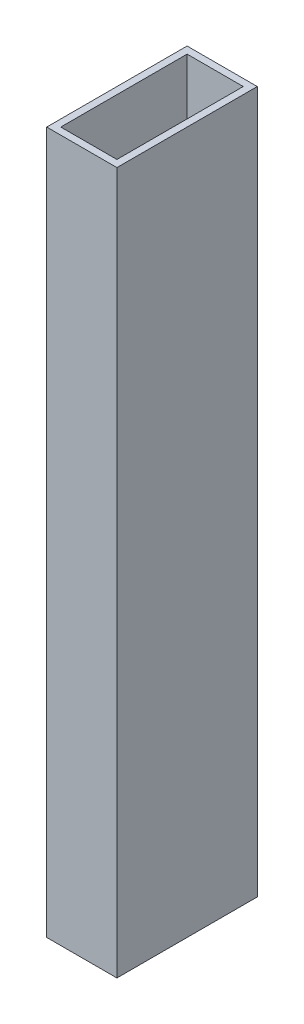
ISO-10303-21;
HEADER;
FILE_DESCRIPTION(('STEP AP214'),'2;1');
FILE_NAME('part.step','',(''),(''),'','','');
FILE_SCHEMA(('AUTOMOTIVE_DESIGN { 1 0 10303 214 1 1 1 1 }'));
ENDSEC;
DATA;
#1=APPLICATION_CONTEXT('core data for automotive mechanical design processes');
#2=APPLICATION_PROTOCOL_DEFINITION('international standard','automotive_design',2000,#1);
#3=PRODUCT_CONTEXT('',#1,'mechanical');
#4=PRODUCT('Part','Part','',(#3));
#5=PRODUCT_RELATED_PRODUCT_CATEGORY('part','',(#4));
#6=PRODUCT_DEFINITION_FORMATION('','',#4);
#7=PRODUCT_DEFINITION_CONTEXT('part definition',#1,'design');
#8=PRODUCT_DEFINITION('design','',#6,#7);
#9=PRODUCT_DEFINITION_SHAPE('','',#8);
#10=(LENGTH_UNIT() NAMED_UNIT(*) SI_UNIT(.MILLI.,.METRE.));
#11=(NAMED_UNIT(*) PLANE_ANGLE_UNIT() SI_UNIT($,.RADIAN.));
#12=(NAMED_UNIT(*) SI_UNIT($,.STERADIAN.) SOLID_ANGLE_UNIT());
#13=UNCERTAINTY_MEASURE_WITH_UNIT(LENGTH_MEASURE(1.E-05),#10,'distance_accuracy_value','');
#14=(GEOMETRIC_REPRESENTATION_CONTEXT(3) GLOBAL_UNCERTAINTY_ASSIGNED_CONTEXT((#13)) GLOBAL_UNIT_ASSIGNED_CONTEXT((#10,
#11,#12)) REPRESENTATION_CONTEXT('',''));
#15=CARTESIAN_POINT('',(0.,0.,0.));
#16=DIRECTION('',(0.,0.,1.));
#17=DIRECTION('',(1.,0.,0.));
#18=AXIS2_PLACEMENT_3D('',#15,#16,#17);
#19=CARTESIAN_POINT('',(0.,100.,0.));
#20=DIRECTION('',(0.,1.,0.));
#21=DIRECTION('',(0.,0.,1.));
#22=AXIS2_PLACEMENT_3D('',#19,#20,#21);
#23=PLANE('',#22);
#24=DIRECTION('',(0.,0.,1.));
#25=VECTOR('',#24,1.);
#26=CARTESIAN_POINT('',(-5.,100.,10.));
#27=LINE('',#26,#25);
#28=CARTESIAN_POINT('',(-5.,100.,-9.99999999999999));
#29=VERTEX_POINT('',#28);
#30=CARTESIAN_POINT('',(-5.,100.,10.));
#31=VERTEX_POINT('',#30);
#32=EDGE_CURVE('E135',#29,#31,#27,.T.);
#33=ORIENTED_EDGE('',*,*,#32,.T.);
#34=DIRECTION('',(1.,0.,0.));
#35=VECTOR('',#34,1.);
#36=CARTESIAN_POINT('',(5.,100.,10.));
#37=LINE('',#36,#35);
#38=CARTESIAN_POINT('',(5.,100.,10.));
#39=VERTEX_POINT('',#38);
#40=EDGE_CURVE('E138',#31,#39,#37,.T.);
#41=ORIENTED_EDGE('',*,*,#40,.T.);
#42=DIRECTION('',(0.,0.,-1.));
#43=VECTOR('',#42,1.);
#44=CARTESIAN_POINT('',(5.,100.,10.));
#45=LINE('',#44,#43);
#46=CARTESIAN_POINT('',(5.,100.,-10.));
#47=VERTEX_POINT('',#46);
#48=EDGE_CURVE('E141',#39,#47,#45,.T.);
#49=ORIENTED_EDGE('',*,*,#48,.T.);
#50=DIRECTION('',(-1.,0.,0.));
#51=VECTOR('',#50,1.);
#52=CARTESIAN_POINT('',(5.,100.,-10.));
#53=LINE('',#52,#51);
#54=EDGE_CURVE('E143',#47,#29,#53,.T.);
#55=ORIENTED_EDGE('',*,*,#54,.T.);
#56=EDGE_LOOP('',(#33,#41,#49,#55));
#57=FACE_BOUND('',#56,.T.);
#58=DIRECTION('',(1.,0.,0.));
#59=VECTOR('',#58,1.);
#60=CARTESIAN_POINT('',(4.,100.,9.));
#61=LINE('',#60,#59);
#62=CARTESIAN_POINT('',(-4.,100.,9.));
#63=VERTEX_POINT('',#62);
#64=CARTESIAN_POINT('',(4.,100.,9.));
#65=VERTEX_POINT('',#64);
#66=EDGE_CURVE('E107',#63,#65,#61,.T.);
#67=ORIENTED_EDGE('',*,*,#66,.F.);
#68=DIRECTION('',(0.,0.,1.));
#69=VECTOR('',#68,1.);
#70=CARTESIAN_POINT('',(-4.,100.,9.));
#71=LINE('',#70,#69);
#72=CARTESIAN_POINT('',(-4.,100.,-9.));
#73=VERTEX_POINT('',#72);
#74=EDGE_CURVE('E99',#73,#63,#71,.T.);
#75=ORIENTED_EDGE('',*,*,#74,.F.);
#76=DIRECTION('',(-1.,0.,0.));
#77=VECTOR('',#76,1.);
#78=CARTESIAN_POINT('',(4.,100.,-9.));
#79=LINE('',#78,#77);
#80=CARTESIAN_POINT('',(4.,100.,-9.));
#81=VERTEX_POINT('',#80);
#82=EDGE_CURVE('E121',#81,#73,#79,.T.);
#83=ORIENTED_EDGE('',*,*,#82,.F.);
#84=DIRECTION('',(0.,0.,-1.));
#85=VECTOR('',#84,1.);
#86=CARTESIAN_POINT('',(4.,100.,9.));
#87=LINE('',#86,#85);
#88=EDGE_CURVE('E119',#65,#81,#87,.T.);
#89=ORIENTED_EDGE('',*,*,#88,.F.);
#90=EDGE_LOOP('',(#67,#75,#83,#89));
#91=FACE_BOUND('',#90,.T.);
#92=ADVANCED_FACE('F34',(#57,#91),#23,.T.);
#93=CARTESIAN_POINT('',(0.,0.,0.));
#94=DIRECTION('',(0.,1.,0.));
#95=DIRECTION('',(0.,0.,1.));
#96=AXIS2_PLACEMENT_3D('',#93,#94,#95);
#97=PLANE('',#96);
#98=DIRECTION('',(0.,0.,1.));
#99=VECTOR('',#98,1.);
#100=CARTESIAN_POINT('',(-5.,0.,10.));
#101=LINE('',#100,#99);
#102=CARTESIAN_POINT('',(-5.,0.,-9.99999999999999));
#103=VERTEX_POINT('',#102);
#104=CARTESIAN_POINT('',(-5.,0.,10.));
#105=VERTEX_POINT('',#104);
#106=EDGE_CURVE('E115',#103,#105,#101,.T.);
#107=ORIENTED_EDGE('',*,*,#106,.F.);
#108=DIRECTION('',(-1.,0.,0.));
#109=VECTOR('',#108,1.);
#110=CARTESIAN_POINT('',(5.,0.,-10.));
#111=LINE('',#110,#109);
#112=CARTESIAN_POINT('',(5.,0.,-10.));
#113=VERTEX_POINT('',#112);
#114=EDGE_CURVE('E139',#113,#103,#111,.T.);
#115=ORIENTED_EDGE('',*,*,#114,.F.);
#116=DIRECTION('',(0.,0.,-1.));
#117=VECTOR('',#116,1.);
#118=CARTESIAN_POINT('',(5.,0.,10.));
#119=LINE('',#118,#117);
#120=CARTESIAN_POINT('',(5.,0.,10.));
#121=VERTEX_POINT('',#120);
#122=EDGE_CURVE('E150',#121,#113,#119,.T.);
#123=ORIENTED_EDGE('',*,*,#122,.F.);
#124=DIRECTION('',(1.,0.,0.));
#125=VECTOR('',#124,1.);
#126=CARTESIAN_POINT('',(5.,0.,10.));
#127=LINE('',#126,#125);
#128=EDGE_CURVE('E148',#105,#121,#127,.T.);
#129=ORIENTED_EDGE('',*,*,#128,.F.);
#130=EDGE_LOOP('',(#107,#115,#123,#129));
#131=FACE_BOUND('',#130,.T.);
#132=DIRECTION('',(0.,0.,1.));
#133=VECTOR('',#132,1.);
#134=CARTESIAN_POINT('',(-4.,0.,9.));
#135=LINE('',#134,#133);
#136=CARTESIAN_POINT('',(-4.,0.,-9.));
#137=VERTEX_POINT('',#136);
#138=CARTESIAN_POINT('',(-4.,0.,9.));
#139=VERTEX_POINT('',#138);
#140=EDGE_CURVE('E57',#137,#139,#135,.T.);
#141=ORIENTED_EDGE('',*,*,#140,.T.);
#142=DIRECTION('',(1.,0.,0.));
#143=VECTOR('',#142,1.);
#144=CARTESIAN_POINT('',(4.,0.,9.));
#145=LINE('',#144,#143);
#146=CARTESIAN_POINT('',(4.,0.,9.));
#147=VERTEX_POINT('',#146);
#148=EDGE_CURVE('E114',#139,#147,#145,.T.);
#149=ORIENTED_EDGE('',*,*,#148,.T.);
#150=DIRECTION('',(0.,0.,-1.));
#151=VECTOR('',#150,1.);
#152=CARTESIAN_POINT('',(4.,0.,9.));
#153=LINE('',#152,#151);
#154=CARTESIAN_POINT('',(4.,0.,-9.));
#155=VERTEX_POINT('',#154);
#156=EDGE_CURVE('E127',#147,#155,#153,.T.);
#157=ORIENTED_EDGE('',*,*,#156,.T.);
#158=DIRECTION('',(-1.,0.,0.));
#159=VECTOR('',#158,1.);
#160=CARTESIAN_POINT('',(4.,0.,-9.));
#161=LINE('',#160,#159);
#162=EDGE_CURVE('E108',#155,#137,#161,.T.);
#163=ORIENTED_EDGE('',*,*,#162,.T.);
#164=EDGE_LOOP('',(#141,#149,#157,#163));
#165=FACE_BOUND('',#164,.T.);
#166=ADVANCED_FACE('F168',(#131,#165),#97,.F.);
#167=CARTESIAN_POINT('',(-5.,100.,10.));
#168=DIRECTION('',(1.,0.,0.));
#169=DIRECTION('',(0.,0.,-1.));
#170=AXIS2_PLACEMENT_3D('',#167,#168,#169);
#171=PLANE('',#170);
#172=ORIENTED_EDGE('',*,*,#106,.T.);
#173=DIRECTION('',(0.,-1.,0.));
#174=VECTOR('',#173,1.);
#175=CARTESIAN_POINT('',(-5.,100.,10.));
#176=LINE('',#175,#174);
#177=EDGE_CURVE('E11',#31,#105,#176,.T.);
#178=ORIENTED_EDGE('',*,*,#177,.F.);
#179=ORIENTED_EDGE('',*,*,#32,.F.);
#180=DIRECTION('',(0.,-1.,0.));
#181=VECTOR('',#180,1.);
#182=CARTESIAN_POINT('',(-5.,100.,-9.99999999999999));
#183=LINE('',#182,#181);
#184=EDGE_CURVE('E145',#29,#103,#183,.T.);
#185=ORIENTED_EDGE('',*,*,#184,.T.);
#186=EDGE_LOOP('',(#172,#178,#179,#185));
#187=FACE_BOUND('',#186,.T.);
#188=ADVANCED_FACE('F36',(#187),#171,.F.);
#189=CARTESIAN_POINT('',(5.,100.,10.));
#190=DIRECTION('',(0.,0.,-1.));
#191=DIRECTION('',(-1.,0.,0.));
#192=AXIS2_PLACEMENT_3D('',#189,#190,#191);
#193=PLANE('',#192);
#194=ORIENTED_EDGE('',*,*,#128,.T.);
#195=DIRECTION('',(0.,-1.,0.));
#196=VECTOR('',#195,1.);
#197=CARTESIAN_POINT('',(5.,100.,10.));
#198=LINE('',#197,#196);
#199=EDGE_CURVE('E42',#39,#121,#198,.T.);
#200=ORIENTED_EDGE('',*,*,#199,.F.);
#201=ORIENTED_EDGE('',*,*,#40,.F.);
#202=ORIENTED_EDGE('',*,*,#177,.T.);
#203=EDGE_LOOP('',(#194,#200,#201,#202));
#204=FACE_BOUND('',#203,.T.);
#205=ADVANCED_FACE('F178',(#204),#193,.F.);
#206=CARTESIAN_POINT('',(5.,100.,10.));
#207=DIRECTION('',(-1.,0.,0.));
#208=DIRECTION('',(0.,0.,1.));
#209=AXIS2_PLACEMENT_3D('',#206,#207,#208);
#210=PLANE('',#209);
#211=ORIENTED_EDGE('',*,*,#122,.T.);
#212=DIRECTION('',(0.,-1.,0.));
#213=VECTOR('',#212,1.);
#214=CARTESIAN_POINT('',(5.,100.,-10.));
#215=LINE('',#214,#213);
#216=EDGE_CURVE('E155',#47,#113,#215,.T.);
#217=ORIENTED_EDGE('',*,*,#216,.F.);
#218=ORIENTED_EDGE('',*,*,#48,.F.);
#219=ORIENTED_EDGE('',*,*,#199,.T.);
#220=EDGE_LOOP('',(#211,#217,#218,#219));
#221=FACE_BOUND('',#220,.T.);
#222=ADVANCED_FACE('F162',(#221),#210,.F.);
#223=CARTESIAN_POINT('',(5.,100.,-10.));
#224=DIRECTION('',(0.,0.,1.));
#225=DIRECTION('',(1.,0.,0.));
#226=AXIS2_PLACEMENT_3D('',#223,#224,#225);
#227=PLANE('',#226);
#228=ORIENTED_EDGE('',*,*,#114,.T.);
#229=ORIENTED_EDGE('',*,*,#184,.F.);
#230=ORIENTED_EDGE('',*,*,#54,.F.);
#231=ORIENTED_EDGE('',*,*,#216,.T.);
#232=EDGE_LOOP('',(#228,#229,#230,#231));
#233=FACE_BOUND('',#232,.T.);
#234=ADVANCED_FACE('F172',(#233),#227,.F.);
#235=CARTESIAN_POINT('',(-4.,100.,9.));
#236=DIRECTION('',(1.,0.,0.));
#237=DIRECTION('',(0.,0.,-1.));
#238=AXIS2_PLACEMENT_3D('',#235,#236,#237);
#239=PLANE('',#238);
#240=ORIENTED_EDGE('',*,*,#140,.F.);
#241=DIRECTION('',(0.,-1.,0.));
#242=VECTOR('',#241,1.);
#243=CARTESIAN_POINT('',(-4.,100.,-9.));
#244=LINE('',#243,#242);
#245=EDGE_CURVE('E103',#73,#137,#244,.T.);
#246=ORIENTED_EDGE('',*,*,#245,.F.);
#247=ORIENTED_EDGE('',*,*,#74,.T.);
#248=DIRECTION('',(0.,-1.,0.));
#249=VECTOR('',#248,1.);
#250=CARTESIAN_POINT('',(-4.,100.,9.));
#251=LINE('',#250,#249);
#252=EDGE_CURVE('E102',#63,#139,#251,.T.);
#253=ORIENTED_EDGE('',*,*,#252,.T.);
#254=EDGE_LOOP('',(#240,#246,#247,#253));
#255=FACE_BOUND('',#254,.T.);
#256=ADVANCED_FACE('F101',(#255),#239,.T.);
#257=CARTESIAN_POINT('',(4.,100.,9.));
#258=DIRECTION('',(0.,0.,-1.));
#259=DIRECTION('',(-1.,0.,0.));
#260=AXIS2_PLACEMENT_3D('',#257,#258,#259);
#261=PLANE('',#260);
#262=ORIENTED_EDGE('',*,*,#148,.F.);
#263=ORIENTED_EDGE('',*,*,#252,.F.);
#264=ORIENTED_EDGE('',*,*,#66,.T.);
#265=DIRECTION('',(0.,-1.,0.));
#266=VECTOR('',#265,1.);
#267=CARTESIAN_POINT('',(4.,100.,9.));
#268=LINE('',#267,#266);
#269=EDGE_CURVE('E116',#65,#147,#268,.T.);
#270=ORIENTED_EDGE('',*,*,#269,.T.);
#271=EDGE_LOOP('',(#262,#263,#264,#270));
#272=FACE_BOUND('',#271,.T.);
#273=ADVANCED_FACE('F111',(#272),#261,.T.);
#274=CARTESIAN_POINT('',(4.,100.,9.));
#275=DIRECTION('',(-1.,0.,0.));
#276=DIRECTION('',(0.,0.,1.));
#277=AXIS2_PLACEMENT_3D('',#274,#275,#276);
#278=PLANE('',#277);
#279=ORIENTED_EDGE('',*,*,#156,.F.);
#280=ORIENTED_EDGE('',*,*,#269,.F.);
#281=ORIENTED_EDGE('',*,*,#88,.T.);
#282=DIRECTION('',(0.,-1.,0.));
#283=VECTOR('',#282,1.);
#284=CARTESIAN_POINT('',(4.,100.,-9.));
#285=LINE('',#284,#283);
#286=EDGE_CURVE('E49',#81,#155,#285,.T.);
#287=ORIENTED_EDGE('',*,*,#286,.T.);
#288=EDGE_LOOP('',(#279,#280,#281,#287));
#289=FACE_BOUND('',#288,.T.);
#290=ADVANCED_FACE('F201',(#289),#278,.T.);
#291=CARTESIAN_POINT('',(4.,100.,-9.));
#292=DIRECTION('',(0.,0.,1.));
#293=DIRECTION('',(1.,0.,0.));
#294=AXIS2_PLACEMENT_3D('',#291,#292,#293);
#295=PLANE('',#294);
#296=ORIENTED_EDGE('',*,*,#162,.F.);
#297=ORIENTED_EDGE('',*,*,#286,.F.);
#298=ORIENTED_EDGE('',*,*,#82,.T.);
#299=ORIENTED_EDGE('',*,*,#245,.T.);
#300=EDGE_LOOP('',(#296,#297,#298,#299));
#301=FACE_BOUND('',#300,.T.);
#302=ADVANCED_FACE('F205',(#301),#295,.T.);
#303=CLOSED_SHELL('',(#92,#166,#188,#205,#222,#234,#256,#273,#290,#302));
#304=MANIFOLD_SOLID_BREP('B2',#303);
#305=ADVANCED_BREP_SHAPE_REPRESENTATION('',(#18,#304),#14);
#306=SHAPE_DEFINITION_REPRESENTATION(#9,#305);
ENDSEC;
END-ISO-10303-21;
